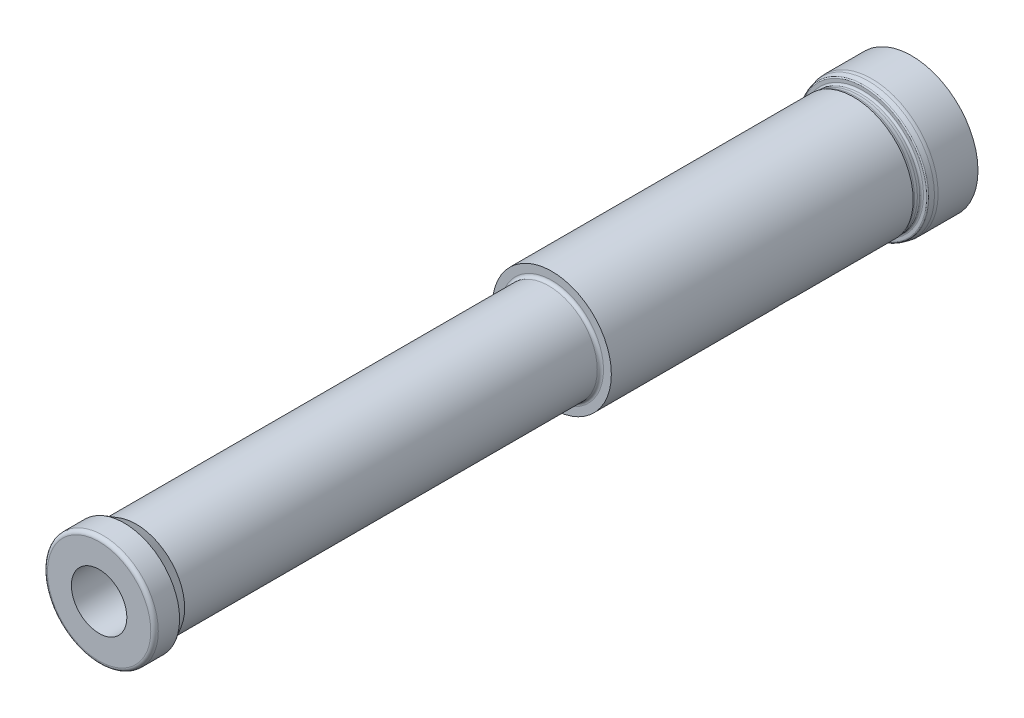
ISO-10303-21;
HEADER;
FILE_DESCRIPTION(('STEP AP214'),'2;1');
FILE_NAME('part.step','',(''),(''),'','','');
FILE_SCHEMA(('AUTOMOTIVE_DESIGN { 1 0 10303 214 1 1 1 1 }'));
ENDSEC;
DATA;
#1=APPLICATION_CONTEXT('core data for automotive mechanical design processes');
#2=APPLICATION_PROTOCOL_DEFINITION('international standard','automotive_design',2000,#1);
#3=PRODUCT_CONTEXT('',#1,'mechanical');
#4=PRODUCT('Part','Part','',(#3));
#5=PRODUCT_RELATED_PRODUCT_CATEGORY('part','',(#4));
#6=PRODUCT_DEFINITION_FORMATION('','',#4);
#7=PRODUCT_DEFINITION_CONTEXT('part definition',#1,'design');
#8=PRODUCT_DEFINITION('design','',#6,#7);
#9=PRODUCT_DEFINITION_SHAPE('','',#8);
#10=(LENGTH_UNIT() NAMED_UNIT(*) SI_UNIT(.MILLI.,.METRE.));
#11=(NAMED_UNIT(*) PLANE_ANGLE_UNIT() SI_UNIT($,.RADIAN.));
#12=(NAMED_UNIT(*) SI_UNIT($,.STERADIAN.) SOLID_ANGLE_UNIT());
#13=UNCERTAINTY_MEASURE_WITH_UNIT(LENGTH_MEASURE(1.E-05),#10,'distance_accuracy_value','');
#14=(GEOMETRIC_REPRESENTATION_CONTEXT(3) GLOBAL_UNCERTAINTY_ASSIGNED_CONTEXT((#13)) GLOBAL_UNIT_ASSIGNED_CONTEXT((#10,
#11,#12)) REPRESENTATION_CONTEXT('',''));
#15=CARTESIAN_POINT('',(0.,0.,0.));
#16=DIRECTION('',(0.,0.,1.));
#17=DIRECTION('',(1.,0.,0.));
#18=AXIS2_PLACEMENT_3D('',#15,#16,#17);
#19=CARTESIAN_POINT('',(0.,0.,20.9919525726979));
#20=DIRECTION('',(0.,0.,1.));
#21=DIRECTION('',(1.,0.,0.));
#22=AXIS2_PLACEMENT_3D('',#19,#20,#21);
#23=CYLINDRICAL_SURFACE('',#22,9.5);
#24=CARTESIAN_POINT('',(0.,0.,-120.5));
#25=DIRECTION('',(0.,0.,1.));
#26=DIRECTION('',(1.,0.,0.));
#27=AXIS2_PLACEMENT_3D('',#24,#25,#26);
#28=CIRCLE('',#27,9.5);
#29=CARTESIAN_POINT('',(9.5,0.,-120.5));
#30=VERTEX_POINT('',#29);
#31=EDGE_CURVE('E363',#30,#30,#28,.T.);
#32=ORIENTED_EDGE('',*,*,#31,.T.);
#33=EDGE_LOOP('',(#32));
#34=FACE_BOUND('',#33,.T.);
#35=CARTESIAN_POINT('',(0.,0.,-72.3));
#36=DIRECTION('',(0.,0.,1.));
#37=DIRECTION('',(1.,0.,0.));
#38=AXIS2_PLACEMENT_3D('',#35,#36,#37);
#39=CIRCLE('',#38,9.5);
#40=CARTESIAN_POINT('',(9.5,0.,-72.3));
#41=VERTEX_POINT('',#40);
#42=EDGE_CURVE('E366',#41,#41,#39,.T.);
#43=ORIENTED_EDGE('',*,*,#42,.F.);
#44=EDGE_LOOP('',(#43));
#45=FACE_BOUND('',#44,.T.);
#46=CARTESIAN_POINT('',(0.414051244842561,-9.4909726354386,-103.824889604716));
#47=CARTESIAN_POINT('',(0.466166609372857,-9.48869381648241,-103.930075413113));
#48=CARTESIAN_POINT('',(0.522848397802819,-9.48579604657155,-104.032901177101));
#49=CARTESIAN_POINT('',(0.644679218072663,-9.47829842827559,-104.233302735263));
#50=CARTESIAN_POINT('',(0.709825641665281,-9.47369910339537,-104.330880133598));
#51=CARTESIAN_POINT('',(0.916930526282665,-9.45665758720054,-104.614922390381));
#52=CARTESIAN_POINT('',(1.07062117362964,-9.44097017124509,-104.792829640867));
#53=CARTESIAN_POINT('',(1.40314310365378,-9.3973017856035,-105.121224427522));
#54=CARTESIAN_POINT('',(1.58196286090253,-9.36932643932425,-105.271724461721));
#55=CARTESIAN_POINT('',(1.95896534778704,-9.29780583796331,-105.541625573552));
#56=CARTESIAN_POINT('',(2.1571428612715,-9.25426476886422,-105.66103499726));
#57=CARTESIAN_POINT('',(2.56557785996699,-9.1494280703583,-105.864441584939));
#58=CARTESIAN_POINT('',(2.77578247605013,-9.08820597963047,-105.948581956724));
#59=CARTESIAN_POINT('',(3.20165993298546,-8.9470423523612,-106.078655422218));
#60=CARTESIAN_POINT('',(3.41732981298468,-8.86711076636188,-106.124608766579));
#61=CARTESIAN_POINT('',(3.83056749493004,-8.69615381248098,-106.174259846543));
#62=CARTESIAN_POINT('',(4.02830822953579,-8.60636290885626,-106.180795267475));
#63=CARTESIAN_POINT('',(4.41555713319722,-8.41424629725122,-106.158900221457));
#64=CARTESIAN_POINT('',(4.60506682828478,-8.31192292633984,-106.130476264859));
#65=CARTESIAN_POINT('',(4.96443289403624,-8.10223928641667,-106.041449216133));
#66=CARTESIAN_POINT('',(5.13473631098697,-7.99516488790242,-105.981962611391));
#67=CARTESIAN_POINT('',(5.45931476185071,-7.77715522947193,-105.83366573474));
#68=CARTESIAN_POINT('',(5.61358662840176,-7.66621921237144,-105.744849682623));
#69=CARTESIAN_POINT('',(5.91087853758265,-7.43963340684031,-105.535562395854));
#70=CARTESIAN_POINT('',(6.05298521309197,-7.32401705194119,-105.413760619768));
#71=CARTESIAN_POINT('',(6.31557188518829,-7.09883964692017,-105.143973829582));
#72=CARTESIAN_POINT('',(6.43604146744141,-6.98928153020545,-104.995976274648));
#73=CARTESIAN_POINT('',(6.6620259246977,-6.7744658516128,-104.665891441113));
#74=CARTESIAN_POINT('',(6.76591621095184,-6.67003842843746,-104.482148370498));
#75=CARTESIAN_POINT('',(6.94705158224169,-6.48117878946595,-104.0923269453));
#76=CARTESIAN_POINT('',(7.02429669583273,-6.3967465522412,-103.886248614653));
#77=CARTESIAN_POINT('',(7.11910914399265,-6.29050782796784,-103.565593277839));
#78=CARTESIAN_POINT('',(7.14712821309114,-6.25859050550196,-103.457274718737));
#79=CARTESIAN_POINT('',(7.19628208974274,-6.20201063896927,-103.237249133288));
#80=CARTESIAN_POINT('',(7.21742004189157,-6.17734478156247,-103.125543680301));
#81=CARTESIAN_POINT('',(7.25270177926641,-6.13588284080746,-102.89965794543));
#82=CARTESIAN_POINT('',(7.26684908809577,-6.11908279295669,-102.785478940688));
#83=CARTESIAN_POINT('',(7.28808750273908,-6.09377194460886,-102.555559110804));
#84=CARTESIAN_POINT('',(7.29517939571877,-6.08526021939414,-102.439818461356));
#85=CARTESIAN_POINT('',(7.30195721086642,-6.07712457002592,-102.217898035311));
#86=CARTESIAN_POINT('',(7.30223302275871,-6.0767927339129,-102.111761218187));
#87=CARTESIAN_POINT('',(7.29686638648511,-6.08323590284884,-101.899856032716));
#88=CARTESIAN_POINT('',(7.29122418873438,-6.09001060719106,-101.794087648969));
#89=CARTESIAN_POINT('',(7.2740521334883,-6.11051092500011,-101.583728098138));
#90=CARTESIAN_POINT('',(7.26252311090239,-6.12423555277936,-101.479136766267));
#91=CARTESIAN_POINT('',(7.23363830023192,-6.15832543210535,-101.271895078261));
#92=CARTESIAN_POINT('',(7.21628426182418,-6.17868868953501,-101.169244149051));
#93=CARTESIAN_POINT('',(7.1757022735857,-6.22577517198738,-100.965934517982));
#94=CARTESIAN_POINT('',(7.15243990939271,-6.25253560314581,-100.865291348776));
#95=CARTESIAN_POINT('',(7.10025071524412,-6.31173159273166,-100.66750578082));
#96=CARTESIAN_POINT('',(7.07133935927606,-6.34415162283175,-100.570354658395));
#97=CARTESIAN_POINT('',(7.03961910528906,-6.37916631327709,-100.47511171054));
#98=B_SPLINE_CURVE_WITH_KNOTS('',3,(#46,#47,#48,#49,#50,#51,#52,#53,#54,#55,#56,#57,#58,#59,#60,
#61,#62,#63,#64,#65,#66,#67,#68,#69,#70,#71,#72,#73,#74,#75,#76,#77,#78,#79,#80,#81,#82,#83,#84,
#85,#86,#87,#88,#89,#90,#91,#92,#93,#94,#95,#96,#97),.UNSPECIFIED.,.F.,.F.,(4,2,2,2,2,2,2,2,2,2,
2,2,2,2,2,2,2,2,2,2,2,2,2,2,2,4),(0.,0.351979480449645,0.703850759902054,1.4071546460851,
2.11013700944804,2.81293046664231,3.51284196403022,4.21238205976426,4.86089683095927,
5.50929084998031,6.13583836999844,6.76250944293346,7.4196879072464,8.07718184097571,
8.78044081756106,9.48369904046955,9.83234624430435,10.1808338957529,10.5291457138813,
10.8774186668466,11.1954342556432,11.5134363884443,11.8313934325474,12.1492550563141,
12.4690123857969,12.7879057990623),.UNSPECIFIED.);
#99=CARTESIAN_POINT('',(0.414051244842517,-9.49097263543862,-103.824889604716));
#100=VERTEX_POINT('',#99);
#101=CARTESIAN_POINT('',(7.03961910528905,-6.3791663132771,-100.475111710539));
#102=VERTEX_POINT('',#101);
#103=EDGE_CURVE('E11',#100,#102,#98,.T.);
#104=ORIENTED_EDGE('',*,*,#103,.F.);
#105=CARTESIAN_POINT('',(0.41405124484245,-9.4909726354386,-103.824889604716));
#106=CARTESIAN_POINT('',(0.239199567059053,-9.49858105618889,-103.442892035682));
#107=CARTESIAN_POINT('',(0.0659728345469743,-9.50131647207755,-103.060069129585));
#108=CARTESIAN_POINT('',(-0.277298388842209,-9.49750826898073,-102.293088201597));
#109=CARTESIAN_POINT('',(-0.447343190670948,-9.49096556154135,-101.908930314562));
#110=CARTESIAN_POINT('',(-0.78434495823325,-9.46906988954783,-101.139537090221));
#111=CARTESIAN_POINT('',(-0.951302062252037,-9.4537173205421,-100.754301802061));
#112=CARTESIAN_POINT('',(-1.28215454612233,-9.41455423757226,-99.9829262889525));
#113=CARTESIAN_POINT('',(-1.44604972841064,-9.39074317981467,-99.5967860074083));
#114=CARTESIAN_POINT('',(-1.8736308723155,-9.31729360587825,-98.5788825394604));
#115=CARTESIAN_POINT('',(-2.13474672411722,-9.26084981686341,-97.9465128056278));
#116=CARTESIAN_POINT('',(-2.52006455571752,-9.16061527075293,-96.9970772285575));
#117=CARTESIAN_POINT('',(-2.64744544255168,-9.12460861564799,-96.6804494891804));
#118=CARTESIAN_POINT('',(-2.90005984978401,-9.04749046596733,-96.0469694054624));
#119=CARTESIAN_POINT('',(-3.02529343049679,-9.00637911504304,-95.7301170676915));
#120=CARTESIAN_POINT('',(-3.14944293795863,-8.96275678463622,-95.4131772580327));
#121=B_SPLINE_CURVE_WITH_KNOTS('',3,(#105,#106,#107,#108,#109,#110,#111,#112,#113,#114,#115,
#116,#117,#118,#119,#120),.UNSPECIFIED.,.F.,.F.,(4,2,2,2,2,2,2,4),(0.,1.26049352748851,
2.5208632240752,3.78117633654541,5.0415704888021,7.10057370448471,8.13009079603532,
9.15957892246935),.UNSPECIFIED.);
#122=CARTESIAN_POINT('',(-3.14944293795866,-8.96275678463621,-95.4131772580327));
#123=VERTEX_POINT('',#122);
#124=EDGE_CURVE('E49',#100,#123,#121,.T.);
#125=ORIENTED_EDGE('',*,*,#124,.T.);
#126=CARTESIAN_POINT('',(-4.025,-8.60519465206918,-90.8087010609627));
#127=CARTESIAN_POINT('',(-4.0273578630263,-8.60406756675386,-91.0118774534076));
#128=CARTESIAN_POINT('',(-4.02459475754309,-8.60538211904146,-91.2151287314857));
#129=CARTESIAN_POINT('',(-4.00877610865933,-8.6127755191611,-91.6210776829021));
#130=CARTESIAN_POINT('',(-3.99572388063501,-8.61885283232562,-91.8237755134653));
#131=CARTESIAN_POINT('',(-3.95927728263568,-8.63565256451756,-92.2280546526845));
#132=CARTESIAN_POINT('',(-3.93588246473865,-8.64637518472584,-92.4296359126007));
#133=CARTESIAN_POINT('',(-3.87875155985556,-8.67215521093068,-92.8310984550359));
#134=CARTESIAN_POINT('',(-3.84501294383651,-8.68721367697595,-93.0309793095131));
#135=CARTESIAN_POINT('',(-3.76949497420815,-8.72023518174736,-93.4169009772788));
#136=CARTESIAN_POINT('',(-3.7282931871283,-8.73797999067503,-93.6030739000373));
#137=CARTESIAN_POINT('',(-3.63681908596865,-8.7764460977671,-93.972904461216));
#138=CARTESIAN_POINT('',(-3.58654501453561,-8.79716797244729,-94.1565616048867));
#139=CARTESIAN_POINT('',(-3.47696675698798,-8.84105193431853,-94.5210827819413));
#140=CARTESIAN_POINT('',(-3.41765283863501,-8.86421664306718,-94.7019435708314));
#141=CARTESIAN_POINT('',(-3.29016486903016,-8.91231793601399,-95.0602269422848));
#142=CARTESIAN_POINT('',(-3.22199291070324,-8.93725410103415,-95.2376503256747));
#143=CARTESIAN_POINT('',(-3.14944293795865,-8.9627567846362,-95.4131772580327));
#144=B_SPLINE_CURVE_WITH_KNOTS('',3,(#126,#127,#128,#129,#130,#131,#132,#133,#134,#135,#136,
#137,#138,#139,#140,#141,#142,#143),.UNSPECIFIED.,.F.,.F.,(4,2,2,2,2,2,2,2,4),(0.,
0.609503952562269,1.21881159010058,1.8281456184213,2.43762874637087,3.01187882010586,
3.58624024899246,4.16122445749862,4.73607305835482),.UNSPECIFIED.);
#145=CARTESIAN_POINT('',(-4.025,-8.60519465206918,-90.8087010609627));
#146=VERTEX_POINT('',#145);
#147=EDGE_CURVE('E398',#146,#123,#144,.T.);
#148=ORIENTED_EDGE('',*,*,#147,.F.);
#149=DIRECTION('',(0.,0.,1.));
#150=VECTOR('',#149,1.);
#151=CARTESIAN_POINT('',(-4.025,-8.60519465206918,20.9919525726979));
#152=LINE('',#151,#150);
#153=CARTESIAN_POINT('',(-4.025,-8.60519465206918,-80.425));
#154=VERTEX_POINT('',#153);
#155=EDGE_CURVE('E393',#146,#154,#152,.T.);
#156=ORIENTED_EDGE('',*,*,#155,.T.);
#157=CARTESIAN_POINT('',(4.02499999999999,-8.60519465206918,-80.425));
#158=CARTESIAN_POINT('',(4.02501669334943,-8.60517054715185,-80.3173321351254));
#159=CARTESIAN_POINT('',(4.02068034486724,-8.60721476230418,-80.2096774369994));
#160=CARTESIAN_POINT('',(4.00343221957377,-8.61525943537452,-79.9952507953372));
#161=CARTESIAN_POINT('',(3.99052411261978,-8.62125820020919,-79.8884784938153));
#162=CARTESIAN_POINT('',(3.95633690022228,-8.63699780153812,-79.6770370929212));
#163=CARTESIAN_POINT('',(3.93509418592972,-8.6467223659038,-79.5723609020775));
#164=CARTESIAN_POINT('',(3.8844850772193,-8.66957574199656,-79.3653943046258));
#165=CARTESIAN_POINT('',(3.85511809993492,-8.682704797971,-79.2631040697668));
#166=CARTESIAN_POINT('',(3.75532206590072,-8.72656183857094,-78.9611013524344));
#167=CARTESIAN_POINT('',(3.67312136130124,-8.76179722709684,-78.7657912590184));
#168=CARTESIAN_POINT('',(3.48001748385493,-8.8402652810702,-78.3916344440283));
#169=CARTESIAN_POINT('',(3.36908324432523,-8.88350658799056,-78.2128058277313));
#170=CARTESIAN_POINT('',(3.11411988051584,-8.97617234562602,-77.8653266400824));
#171=CARTESIAN_POINT('',(2.96854829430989,-9.02580973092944,-77.6978620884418));
#172=CARTESIAN_POINT('',(2.65170491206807,-9.12392177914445,-77.3888702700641));
#173=CARTESIAN_POINT('',(2.48042752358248,-9.17239618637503,-77.2473486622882));
#174=CARTESIAN_POINT('',(2.10751032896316,-9.26536108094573,-76.9880142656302));
#175=CARTESIAN_POINT('',(1.90484793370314,-9.30957238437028,-76.8715625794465));
#176=CARTESIAN_POINT('',(1.48059784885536,-9.38638324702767,-76.6749275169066));
#177=CARTESIAN_POINT('',(1.25901896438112,-9.41898817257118,-76.594727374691));
#178=CARTESIAN_POINT('',(0.815820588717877,-9.46738764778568,-76.4772458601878));
#179=CARTESIAN_POINT('',(0.594839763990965,-9.48398950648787,-76.4378945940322));
#180=CARTESIAN_POINT('',(0.148826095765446,-9.50145126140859,-76.3965292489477));
#181=CARTESIAN_POINT('',(-0.0762050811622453,-9.50231749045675,-76.3945001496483));
#182=CARTESIAN_POINT('',(-0.508840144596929,-9.48867797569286,-76.4267755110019));
#183=CARTESIAN_POINT('',(-0.716650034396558,-9.47513550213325,-76.4588030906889));
#184=CARTESIAN_POINT('',(-1.12361759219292,-9.43553384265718,-76.5543662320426));
#185=CARTESIAN_POINT('',(-1.32277477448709,-9.40947395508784,-76.6179035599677));
#186=CARTESIAN_POINT('',(-1.7104583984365,-9.346845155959,-76.7754210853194));
#187=CARTESIAN_POINT('',(-1.89877563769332,-9.31012159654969,-76.8698520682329));
#188=CARTESIAN_POINT('',(-2.25739159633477,-9.22973476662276,-77.0860363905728));
#189=CARTESIAN_POINT('',(-2.42768363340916,-9.18606893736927,-77.2077998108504));
#190=CARTESIAN_POINT('',(-2.75851243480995,-9.09242981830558,-77.4854070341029));
#191=CARTESIAN_POINT('',(-2.91744809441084,-9.04222875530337,-77.6430810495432));
#192=CARTESIAN_POINT('',(-3.20740198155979,-8.94349368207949,-77.9830591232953));
#193=CARTESIAN_POINT('',(-3.33840537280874,-8.89496056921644,-78.1653761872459));
#194=CARTESIAN_POINT('',(-3.51328438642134,-8.8267177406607,-78.4575142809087));
#195=CARTESIAN_POINT('',(-3.56873458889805,-8.80438402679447,-78.5599593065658));
#196=CARTESIAN_POINT('',(-3.67071814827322,-8.7623551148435,-78.7696963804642));
#197=CARTESIAN_POINT('',(-3.7172553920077,-8.74265876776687,-78.8769862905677));
#198=CARTESIAN_POINT('',(-3.80090498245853,-8.70661813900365,-79.0955556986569));
#199=CARTESIAN_POINT('',(-3.83802989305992,-8.69026939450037,-79.2068296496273));
#200=CARTESIAN_POINT('',(-3.90251076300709,-8.66150372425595,-79.4326205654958));
#201=CARTESIAN_POINT('',(-3.92987107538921,-8.64908504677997,-79.5471360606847));
#202=CARTESIAN_POINT('',(-3.97631879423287,-8.62784097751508,-79.7880202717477));
#203=CARTESIAN_POINT('',(-3.99454310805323,-8.61939406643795,-79.9145905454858));
#204=CARTESIAN_POINT('',(-4.01890007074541,-8.60804708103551,-80.1691011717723));
#205=CARTESIAN_POINT('',(-4.02503555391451,-8.6051457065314,-80.2970411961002));
#206=CARTESIAN_POINT('',(-4.025,-8.60519465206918,-80.425));
#207=B_SPLINE_CURVE_WITH_KNOTS('',3,(#157,#158,#159,#160,#161,#162,#163,#164,#165,#166,#167,
#168,#169,#170,#171,#172,#173,#174,#175,#176,#177,#178,#179,#180,#181,#182,#183,#184,#185,#186,
#187,#188,#189,#190,#191,#192,#193,#194,#195,#196,#197,#198,#199,#200,#201,#202,#203,#204,#205,
#206),.UNSPECIFIED.,.F.,.F.,(4,2,2,2,2,2,2,2,2,2,2,2,2,2,2,2,2,2,2,2,2,2,2,2,4),(0.,
0.322875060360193,0.645611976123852,0.96695514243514,1.28832136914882,1.92965165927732,
2.57167827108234,3.25082007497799,3.93010984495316,4.64010964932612,5.34978075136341,
6.0214163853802,6.69278171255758,7.32192694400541,7.95110744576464,8.58991182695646,
9.22895220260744,9.91429981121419,10.6000105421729,10.9554581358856,11.3107503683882,
11.6655658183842,12.0202228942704,12.4039825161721,12.7876521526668),.UNSPECIFIED.);
#208=CARTESIAN_POINT('',(4.02499999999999,-8.60519465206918,-80.425));
#209=VERTEX_POINT('',#208);
#210=EDGE_CURVE('E111',#209,#154,#207,.T.);
#211=ORIENTED_EDGE('',*,*,#210,.F.);
#212=DIRECTION('',(0.,0.,1.));
#213=VECTOR('',#212,1.);
#214=CARTESIAN_POINT('',(4.02499999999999,-8.60519465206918,20.9919525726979));
#215=LINE('',#214,#213);
#216=CARTESIAN_POINT('',(4.02499999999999,-8.60519465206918,-90.8087010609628));
#217=VERTEX_POINT('',#216);
#218=EDGE_CURVE('E394',#209,#217,#215,.F.);
#219=ORIENTED_EDGE('',*,*,#218,.T.);
#220=CARTESIAN_POINT('',(4.27025049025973,-8.48616289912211,-92.3271591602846));
#221=CARTESIAN_POINT('',(4.24568826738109,-8.49852245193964,-92.2606655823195));
#222=CARTESIAN_POINT('',(4.22259993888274,-8.51000693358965,-92.1934404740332));
#223=CARTESIAN_POINT('',(4.17978666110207,-8.53111683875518,-92.0576449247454));
#224=CARTESIAN_POINT('',(4.16006168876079,-8.54074227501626,-91.9890744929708));
#225=CARTESIAN_POINT('',(4.12437999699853,-8.55803036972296,-91.8506648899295));
#226=CARTESIAN_POINT('',(4.10842547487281,-8.56569188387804,-91.7808250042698));
#227=CARTESIAN_POINT('',(4.08055672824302,-8.57900322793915,-91.6401472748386));
#228=CARTESIAN_POINT('',(4.06864271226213,-8.5846529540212,-91.5693093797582));
#229=CARTESIAN_POINT('',(4.05091192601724,-8.59303133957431,-91.4412081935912));
#230=CARTESIAN_POINT('',(4.04435172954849,-8.59611849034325,-91.3840694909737));
#231=CARTESIAN_POINT('',(4.03381844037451,-8.60106635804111,-91.2694879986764));
#232=CARTESIAN_POINT('',(4.02984594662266,-8.60292679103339,-91.2120451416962));
#233=CARTESIAN_POINT('',(4.02438128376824,-8.6054846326,-91.0969397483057));
#234=CARTESIAN_POINT('',(4.02289256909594,-8.60618042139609,-91.039277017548));
#235=CARTESIAN_POINT('',(4.02224284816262,-8.6064834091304,-90.9239589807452));
#236=CARTESIAN_POINT('',(4.02308084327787,-8.60609107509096,-90.8663036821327));
#237=CARTESIAN_POINT('',(4.02499999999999,-8.60519465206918,-90.8087010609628));
#238=B_SPLINE_CURVE_WITH_KNOTS('',3,(#220,#221,#222,#223,#224,#225,#226,#227,#228,#229,#230,
#231,#232,#233,#234,#235,#236,#237),.UNSPECIFIED.,.F.,.F.,(4,2,2,2,2,2,2,2,4),(0.,
0.215873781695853,0.43174608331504,0.64774387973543,0.863752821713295,1.03647243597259,
1.20923201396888,1.38223166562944,1.55515707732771),.UNSPECIFIED.);
#239=CARTESIAN_POINT('',(4.27025049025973,-8.48616289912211,-92.3271591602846));
#240=VERTEX_POINT('',#239);
#241=EDGE_CURVE('E65',#240,#217,#238,.T.);
#242=ORIENTED_EDGE('',*,*,#241,.F.);
#243=CARTESIAN_POINT('',(4.27025049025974,-8.4861628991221,-92.3271591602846));
#244=CARTESIAN_POINT('',(4.41405574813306,-8.41378933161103,-92.7151754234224));
#245=CARTESIAN_POINT('',(4.5562473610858,-8.33766708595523,-93.1030940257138));
#246=CARTESIAN_POINT('',(4.83728263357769,-8.17782849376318,-93.8785988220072));
#247=CARTESIAN_POINT('',(4.97612614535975,-8.09411181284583,-94.2661850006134));
#248=CARTESIAN_POINT('',(5.25033288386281,-7.91899331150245,-95.0408565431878));
#249=CARTESIAN_POINT('',(5.38569608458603,-7.82759143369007,-95.4279419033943));
#250=CARTESIAN_POINT('',(5.65275788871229,-7.63696591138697,-96.2014454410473));
#251=CARTESIAN_POINT('',(5.78445656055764,-7.53774241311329,-96.5878636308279));
#252=CARTESIAN_POINT('',(6.0127144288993,-7.35616086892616,-97.2668416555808));
#253=CARTESIAN_POINT('',(6.11009395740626,-7.27550025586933,-97.5595807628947));
#254=CARTESIAN_POINT('',(6.30252727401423,-7.10945140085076,-98.1444849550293));
#255=CARTESIAN_POINT('',(6.39758105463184,-7.02406314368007,-98.4366500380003));
#256=CARTESIAN_POINT('',(6.58528078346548,-6.84840233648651,-99.0203555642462));
#257=CARTESIAN_POINT('',(6.67792624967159,-6.75812881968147,-99.3118958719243));
#258=CARTESIAN_POINT('',(6.86069191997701,-6.57250575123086,-99.8941560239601));
#259=CARTESIAN_POINT('',(6.95081208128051,-6.47715611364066,-100.184875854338));
#260=CARTESIAN_POINT('',(7.03961910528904,-6.37916631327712,-100.475111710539));
#261=B_SPLINE_CURVE_WITH_KNOTS('',3,(#243,#244,#245,#246,#247,#248,#249,#250,#251,#252,#253,
#254,#255,#256,#257,#258,#259,#260),.UNSPECIFIED.,.F.,.F.,(4,2,2,2,2,2,2,2,4),(0.,
1.2602510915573,2.52055769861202,3.78087371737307,5.04116618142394,5.99776859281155,
6.95437408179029,7.91116957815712,8.86798127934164),.UNSPECIFIED.);
#262=EDGE_CURVE('E265',#240,#102,#261,.T.);
#263=ORIENTED_EDGE('',*,*,#262,.T.);
#264=EDGE_LOOP('',(#104,#125,#148,#156,#211,#219,#242,#263));
#265=FACE_BOUND('',#264,.T.);
#266=ADVANCED_FACE('F39',(#34,#45,#265),#23,.T.);
#267=CARTESIAN_POINT('',(0.,10.6,-129.75));
#268=DIRECTION('',(0.,0.,1.));
#269=DIRECTION('',(1.,0.,0.));
#270=AXIS2_PLACEMENT_3D('',#267,#268,#269);
#271=PLANE('',#270);
#272=CARTESIAN_POINT('',(0.,0.,-129.75));
#273=DIRECTION('',(0.,0.,1.));
#274=DIRECTION('',(1.,0.,0.));
#275=AXIS2_PLACEMENT_3D('',#272,#273,#274);
#276=CIRCLE('',#275,10.6);
#277=CARTESIAN_POINT('',(10.6,0.,-129.75));
#278=VERTEX_POINT('',#277);
#279=EDGE_CURVE('E126',#278,#278,#276,.T.);
#280=ORIENTED_EDGE('',*,*,#279,.F.);
#281=EDGE_LOOP('',(#280));
#282=FACE_BOUND('',#281,.T.);
#283=CARTESIAN_POINT('',(0.,0.,-129.75));
#284=DIRECTION('',(0.,0.,1.));
#285=DIRECTION('',(1.,0.,0.));
#286=AXIS2_PLACEMENT_3D('',#283,#284,#285);
#287=CIRCLE('',#286,4.4275);
#288=CARTESIAN_POINT('',(4.4275,0.,-129.75));
#289=VERTEX_POINT('',#288);
#290=EDGE_CURVE('E389',#289,#289,#287,.T.);
#291=ORIENTED_EDGE('',*,*,#290,.T.);
#292=EDGE_LOOP('',(#291));
#293=FACE_BOUND('',#292,.T.);
#294=ADVANCED_FACE('F41',(#282,#293),#271,.F.);
#295=CARTESIAN_POINT('',(0.,0.,20.9919525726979));
#296=DIRECTION('',(0.,0.,1.));
#297=DIRECTION('',(1.,0.,0.));
#298=AXIS2_PLACEMENT_3D('',#295,#296,#297);
#299=CYLINDRICAL_SURFACE('',#298,4.4275);
#300=ORIENTED_EDGE('',*,*,#290,.F.);
#301=EDGE_LOOP('',(#300));
#302=FACE_BOUND('',#301,.T.);
#303=CARTESIAN_POINT('',(0.,0.,0.));
#304=DIRECTION('',(0.,0.,1.));
#305=DIRECTION('',(1.,0.,0.));
#306=AXIS2_PLACEMENT_3D('',#303,#304,#305);
#307=CIRCLE('',#306,4.4275);
#308=CARTESIAN_POINT('',(4.4275,0.,0.));
#309=VERTEX_POINT('',#308);
#310=EDGE_CURVE('E387',#309,#309,#307,.T.);
#311=ORIENTED_EDGE('',*,*,#310,.T.);
#312=EDGE_LOOP('',(#311));
#313=FACE_BOUND('',#312,.T.);
#314=ADVANCED_FACE('F537',(#302,#313),#299,.F.);
#315=CARTESIAN_POINT('',(0.,4.4275,0.));
#316=DIRECTION('',(0.,0.,-1.));
#317=DIRECTION('',(-1.,0.,0.));
#318=AXIS2_PLACEMENT_3D('',#315,#316,#317);
#319=PLANE('',#318);
#320=ORIENTED_EDGE('',*,*,#310,.F.);
#321=EDGE_LOOP('',(#320));
#322=FACE_BOUND('',#321,.T.);
#323=CARTESIAN_POINT('',(0.,0.,0.));
#324=DIRECTION('',(0.,0.,1.));
#325=DIRECTION('',(1.,0.,0.));
#326=AXIS2_PLACEMENT_3D('',#323,#324,#325);
#327=CIRCLE('',#326,8.25);
#328=CARTESIAN_POINT('',(8.25,0.,0.));
#329=VERTEX_POINT('',#328);
#330=EDGE_CURVE('E384',#329,#329,#327,.T.);
#331=ORIENTED_EDGE('',*,*,#330,.T.);
#332=EDGE_LOOP('',(#331));
#333=FACE_BOUND('',#332,.T.);
#334=ADVANCED_FACE('F541',(#322,#333),#319,.F.);
#335=CARTESIAN_POINT('',(0.,0.,-0.6));
#336=DIRECTION('',(0.,0.,1.));
#337=DIRECTION('',(1.,0.,0.));
#338=AXIS2_PLACEMENT_3D('',#335,#336,#337);
#339=TOROIDAL_SURFACE('',#338,8.25,0.6);
#340=ORIENTED_EDGE('',*,*,#330,.F.);
#341=EDGE_LOOP('',(#340));
#342=FACE_BOUND('',#341,.T.);
#343=CARTESIAN_POINT('',(0.,0.,-0.600000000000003));
#344=DIRECTION('',(0.,0.,1.));
#345=DIRECTION('',(1.,0.,0.));
#346=AXIS2_PLACEMENT_3D('',#343,#344,#345);
#347=CIRCLE('',#346,8.85);
#348=CARTESIAN_POINT('',(8.85,0.,-0.600000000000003));
#349=VERTEX_POINT('',#348);
#350=EDGE_CURVE('E381',#349,#349,#347,.T.);
#351=ORIENTED_EDGE('',*,*,#350,.T.);
#352=EDGE_LOOP('',(#351));
#353=FACE_BOUND('',#352,.T.);
#354=ADVANCED_FACE('F546',(#342,#353),#339,.T.);
#355=CARTESIAN_POINT('',(0.,0.,20.9919525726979));
#356=DIRECTION('',(0.,0.,1.));
#357=DIRECTION('',(1.,0.,0.));
#358=AXIS2_PLACEMENT_3D('',#355,#356,#357);
#359=CYLINDRICAL_SURFACE('',#358,8.85);
#360=ORIENTED_EDGE('',*,*,#350,.F.);
#361=EDGE_LOOP('',(#360));
#362=FACE_BOUND('',#361,.T.);
#363=CARTESIAN_POINT('',(0.,0.,-4.));
#364=DIRECTION('',(0.,0.,1.));
#365=DIRECTION('',(1.,0.,0.));
#366=AXIS2_PLACEMENT_3D('',#363,#364,#365);
#367=CIRCLE('',#366,8.85);
#368=CARTESIAN_POINT('',(8.85,0.,-4.));
#369=VERTEX_POINT('',#368);
#370=EDGE_CURVE('E378',#369,#369,#367,.T.);
#371=ORIENTED_EDGE('',*,*,#370,.T.);
#372=EDGE_LOOP('',(#371));
#373=FACE_BOUND('',#372,.T.);
#374=ADVANCED_FACE('F553',(#362,#373),#359,.T.);
#375=CARTESIAN_POINT('',(0.,0.,-5.90525588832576));
#376=DIRECTION('',(0.,0.,1.));
#377=DIRECTION('',(1.,0.,0.));
#378=AXIS2_PLACEMENT_3D('',#375,#376,#377);
#379=CONICAL_SURFACE('',#378,7.75,0.523598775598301);
#380=ORIENTED_EDGE('',*,*,#370,.F.);
#381=EDGE_LOOP('',(#380));
#382=FACE_BOUND('',#381,.T.);
#383=CARTESIAN_POINT('',(0.,0.,-5.90525588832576));
#384=DIRECTION('',(0.,0.,1.));
#385=DIRECTION('',(1.,0.,0.));
#386=AXIS2_PLACEMENT_3D('',#383,#384,#385);
#387=CIRCLE('',#386,7.75);
#388=CARTESIAN_POINT('',(7.75,0.,-5.90525588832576));
#389=VERTEX_POINT('',#388);
#390=EDGE_CURVE('E375',#389,#389,#387,.T.);
#391=ORIENTED_EDGE('',*,*,#390,.T.);
#392=EDGE_LOOP('',(#391));
#393=FACE_BOUND('',#392,.T.);
#394=ADVANCED_FACE('F557',(#382,#393),#379,.T.);
#395=CARTESIAN_POINT('',(0.,0.,20.9919525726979));
#396=DIRECTION('',(0.,0.,1.));
#397=DIRECTION('',(1.,0.,0.));
#398=AXIS2_PLACEMENT_3D('',#395,#396,#397);
#399=CYLINDRICAL_SURFACE('',#398,7.75);
#400=ORIENTED_EDGE('',*,*,#390,.F.);
#401=EDGE_LOOP('',(#400));
#402=FACE_BOUND('',#401,.T.);
#403=CARTESIAN_POINT('',(0.,0.,-71.8));
#404=DIRECTION('',(0.,0.,1.));
#405=DIRECTION('',(1.,0.,0.));
#406=AXIS2_PLACEMENT_3D('',#403,#404,#405);
#407=CIRCLE('',#406,7.75);
#408=CARTESIAN_POINT('',(7.75,0.,-71.8));
#409=VERTEX_POINT('',#408);
#410=EDGE_CURVE('E372',#409,#409,#407,.T.);
#411=ORIENTED_EDGE('',*,*,#410,.T.);
#412=EDGE_LOOP('',(#411));
#413=FACE_BOUND('',#412,.T.);
#414=ADVANCED_FACE('F561',(#402,#413),#399,.T.);
#415=CARTESIAN_POINT('',(0.,0.,-71.8));
#416=DIRECTION('',(0.,0.,1.));
#417=DIRECTION('',(1.,0.,0.));
#418=AXIS2_PLACEMENT_3D('',#415,#416,#417);
#419=TOROIDAL_SURFACE('',#418,8.25,0.5);
#420=ORIENTED_EDGE('',*,*,#410,.F.);
#421=EDGE_LOOP('',(#420));
#422=FACE_BOUND('',#421,.T.);
#423=CARTESIAN_POINT('',(0.,0.,-72.3));
#424=DIRECTION('',(0.,0.,1.));
#425=DIRECTION('',(1.,0.,0.));
#426=AXIS2_PLACEMENT_3D('',#423,#424,#425);
#427=CIRCLE('',#426,8.25);
#428=CARTESIAN_POINT('',(8.25,0.,-72.3));
#429=VERTEX_POINT('',#428);
#430=EDGE_CURVE('E369',#429,#429,#427,.T.);
#431=ORIENTED_EDGE('',*,*,#430,.T.);
#432=EDGE_LOOP('',(#431));
#433=FACE_BOUND('',#432,.T.);
#434=ADVANCED_FACE('F564',(#422,#433),#419,.F.);
#435=CARTESIAN_POINT('',(0.,8.25,-72.3));
#436=DIRECTION('',(0.,0.,-1.));
#437=DIRECTION('',(-1.,0.,0.));
#438=AXIS2_PLACEMENT_3D('',#435,#436,#437);
#439=PLANE('',#438);
#440=ORIENTED_EDGE('',*,*,#430,.F.);
#441=EDGE_LOOP('',(#440));
#442=FACE_BOUND('',#441,.T.);
#443=ORIENTED_EDGE('',*,*,#42,.T.);
#444=EDGE_LOOP('',(#443));
#445=FACE_BOUND('',#444,.T.);
#446=ADVANCED_FACE('F274',(#442,#445),#439,.F.);
#447=CARTESIAN_POINT('',(0.,0.,-120.805474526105));
#448=DIRECTION('',(0.,0.,1.));
#449=DIRECTION('',(1.,0.,0.));
#450=AXIS2_PLACEMENT_3D('',#447,#448,#449);
#451=CONICAL_SURFACE('',#450,9.41814834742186,0.261799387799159);
#452=ORIENTED_EDGE('',*,*,#31,.F.);
#453=EDGE_LOOP('',(#452));
#454=FACE_BOUND('',#453,.T.);
#455=CARTESIAN_POINT('',(0.,0.,-120.805474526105));
#456=DIRECTION('',(0.,0.,1.));
#457=DIRECTION('',(1.,0.,0.));
#458=AXIS2_PLACEMENT_3D('',#455,#456,#457);
#459=CIRCLE('',#458,9.41814834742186);
#460=CARTESIAN_POINT('',(9.41814834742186,0.,-120.805474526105));
#461=VERTEX_POINT('',#460);
#462=EDGE_CURVE('E360',#461,#461,#459,.T.);
#463=ORIENTED_EDGE('',*,*,#462,.T.);
#464=EDGE_LOOP('',(#463));
#465=FACE_BOUND('',#464,.T.);
#466=ADVANCED_FACE('F272',(#454,#465),#451,.T.);
#467=CARTESIAN_POINT('',(0.,0.,-121.32311261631));
#468=DIRECTION('',(0.,0.,1.));
#469=DIRECTION('',(1.,0.,0.));
#470=AXIS2_PLACEMENT_3D('',#467,#468,#469);
#471=TOROIDAL_SURFACE('',#470,11.35,2.);
#472=ORIENTED_EDGE('',*,*,#462,.F.);
#473=EDGE_LOOP('',(#472));
#474=FACE_BOUND('',#473,.T.);
#475=CARTESIAN_POINT('',(0.,0.,-121.32311261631));
#476=DIRECTION('',(0.,0.,1.));
#477=DIRECTION('',(1.,0.,0.));
#478=AXIS2_PLACEMENT_3D('',#475,#476,#477);
#479=CIRCLE('',#478,9.35);
#480=CARTESIAN_POINT('',(9.35,0.,-121.32311261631));
#481=VERTEX_POINT('',#480);
#482=EDGE_CURVE('E357',#481,#481,#479,.T.);
#483=ORIENTED_EDGE('',*,*,#482,.T.);
#484=EDGE_LOOP('',(#483));
#485=FACE_BOUND('',#484,.T.);
#486=ADVANCED_FACE('F510',(#474,#485),#471,.F.);
#487=CARTESIAN_POINT('',(0.,0.,20.9919525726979));
#488=DIRECTION('',(0.,0.,1.));
#489=DIRECTION('',(1.,0.,0.));
#490=AXIS2_PLACEMENT_3D('',#487,#488,#489);
#491=CYLINDRICAL_SURFACE('',#490,9.35);
#492=ORIENTED_EDGE('',*,*,#482,.F.);
#493=EDGE_LOOP('',(#492));
#494=FACE_BOUND('',#493,.T.);
#495=CARTESIAN_POINT('',(0.,0.,-121.7));
#496=DIRECTION('',(0.,0.,1.));
#497=DIRECTION('',(1.,0.,0.));
#498=AXIS2_PLACEMENT_3D('',#495,#496,#497);
#499=CIRCLE('',#498,9.35);
#500=CARTESIAN_POINT('',(9.35,0.,-121.7));
#501=VERTEX_POINT('',#500);
#502=EDGE_CURVE('E354',#501,#501,#499,.T.);
#503=ORIENTED_EDGE('',*,*,#502,.T.);
#504=EDGE_LOOP('',(#503));
#505=FACE_BOUND('',#504,.T.);
#506=ADVANCED_FACE('F507',(#494,#505),#491,.T.);
#507=CARTESIAN_POINT('',(0.,0.,-121.7));
#508=DIRECTION('',(0.,0.,1.));
#509=DIRECTION('',(1.,0.,0.));
#510=AXIS2_PLACEMENT_3D('',#507,#508,#509);
#511=TOROIDAL_SURFACE('',#510,9.65,0.299999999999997);
#512=ORIENTED_EDGE('',*,*,#502,.F.);
#513=EDGE_LOOP('',(#512));
#514=FACE_BOUND('',#513,.T.);
#515=CARTESIAN_POINT('',(0.,0.,-122.));
#516=DIRECTION('',(0.,0.,1.));
#517=DIRECTION('',(1.,0.,0.));
#518=AXIS2_PLACEMENT_3D('',#515,#516,#517);
#519=CIRCLE('',#518,9.65);
#520=CARTESIAN_POINT('',(9.65,0.,-122.));
#521=VERTEX_POINT('',#520);
#522=EDGE_CURVE('E351',#521,#521,#519,.T.);
#523=ORIENTED_EDGE('',*,*,#522,.T.);
#524=EDGE_LOOP('',(#523));
#525=FACE_BOUND('',#524,.T.);
#526=ADVANCED_FACE('F503',(#514,#525),#511,.F.);
#527=CARTESIAN_POINT('',(0.,9.65,-122.));
#528=DIRECTION('',(0.,0.,-1.));
#529=DIRECTION('',(-1.,0.,0.));
#530=AXIS2_PLACEMENT_3D('',#527,#528,#529);
#531=PLANE('',#530);
#532=ORIENTED_EDGE('',*,*,#522,.F.);
#533=EDGE_LOOP('',(#532));
#534=FACE_BOUND('',#533,.T.);
#535=CARTESIAN_POINT('',(0.,0.,-122.));
#536=DIRECTION('',(0.,0.,1.));
#537=DIRECTION('',(1.,0.,0.));
#538=AXIS2_PLACEMENT_3D('',#535,#536,#537);
#539=CIRCLE('',#538,10.1465346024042);
#540=CARTESIAN_POINT('',(10.1465346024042,0.,-122.));
#541=VERTEX_POINT('',#540);
#542=EDGE_CURVE('E348',#541,#541,#539,.T.);
#543=ORIENTED_EDGE('',*,*,#542,.T.);
#544=EDGE_LOOP('',(#543));
#545=FACE_BOUND('',#544,.T.);
#546=ADVANCED_FACE('F499',(#534,#545),#531,.F.);
#547=CARTESIAN_POINT('',(0.,0.,-122.2));
#548=DIRECTION('',(0.,0.,1.));
#549=DIRECTION('',(1.,0.,0.));
#550=AXIS2_PLACEMENT_3D('',#547,#548,#549);
#551=TOROIDAL_SURFACE('',#550,10.1465346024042,0.200000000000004);
#552=ORIENTED_EDGE('',*,*,#542,.F.);
#553=EDGE_LOOP('',(#552));
#554=FACE_BOUND('',#553,.T.);
#555=CARTESIAN_POINT('',(0.,0.,-122.148236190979));
#556=DIRECTION('',(0.,0.,1.));
#557=DIRECTION('',(1.,0.,0.));
#558=AXIS2_PLACEMENT_3D('',#555,#556,#557);
#559=CIRCLE('',#558,10.339719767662);
#560=CARTESIAN_POINT('',(10.339719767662,0.,-122.148236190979));
#561=VERTEX_POINT('',#560);
#562=EDGE_CURVE('E345',#561,#561,#559,.T.);
#563=ORIENTED_EDGE('',*,*,#562,.T.);
#564=EDGE_LOOP('',(#563));
#565=FACE_BOUND('',#564,.T.);
#566=ADVANCED_FACE('F495',(#554,#565),#551,.T.);
#567=CARTESIAN_POINT('',(0.,0.,-122.86528214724));
#568=DIRECTION('',(0.,0.,-1.));
#569=DIRECTION('',(-1.,0.,0.));
#570=AXIS2_PLACEMENT_3D('',#567,#568,#569);
#571=CONICAL_SURFACE('',#570,10.5318516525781,0.261799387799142);
#572=ORIENTED_EDGE('',*,*,#562,.F.);
#573=EDGE_LOOP('',(#572));
#574=FACE_BOUND('',#573,.T.);
#575=CARTESIAN_POINT('',(0.,0.,-122.86528214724));
#576=DIRECTION('',(0.,0.,1.));
#577=DIRECTION('',(1.,0.,0.));
#578=AXIS2_PLACEMENT_3D('',#575,#576,#577);
#579=CIRCLE('',#578,10.5318516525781);
#580=CARTESIAN_POINT('',(10.5318516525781,0.,-122.86528214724));
#581=VERTEX_POINT('',#580);
#582=EDGE_CURVE('E342',#581,#581,#579,.T.);
#583=ORIENTED_EDGE('',*,*,#582,.T.);
#584=EDGE_LOOP('',(#583));
#585=FACE_BOUND('',#584,.T.);
#586=ADVANCED_FACE('F491',(#574,#585),#571,.T.);
#587=CARTESIAN_POINT('',(0.,0.,-123.382920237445));
#588=DIRECTION('',(0.,0.,1.));
#589=DIRECTION('',(1.,0.,0.));
#590=AXIS2_PLACEMENT_3D('',#587,#588,#589);
#591=TOROIDAL_SURFACE('',#590,8.6,2.);
#592=ORIENTED_EDGE('',*,*,#582,.F.);
#593=EDGE_LOOP('',(#592));
#594=FACE_BOUND('',#593,.T.);
#595=CARTESIAN_POINT('',(0.,0.,-123.382920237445));
#596=DIRECTION('',(0.,0.,1.));
#597=DIRECTION('',(1.,0.,0.));
#598=AXIS2_PLACEMENT_3D('',#595,#596,#597);
#599=CIRCLE('',#598,10.6);
#600=CARTESIAN_POINT('',(10.6,0.,-123.382920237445));
#601=VERTEX_POINT('',#600);
#602=EDGE_CURVE('E339',#601,#601,#599,.T.);
#603=ORIENTED_EDGE('',*,*,#602,.T.);
#604=EDGE_LOOP('',(#603));
#605=FACE_BOUND('',#604,.T.);
#606=ADVANCED_FACE('F487',(#594,#605),#591,.T.);
#607=CARTESIAN_POINT('',(0.,0.,20.9919525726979));
#608=DIRECTION('',(0.,0.,1.));
#609=DIRECTION('',(1.,0.,0.));
#610=AXIS2_PLACEMENT_3D('',#607,#608,#609);
#611=CYLINDRICAL_SURFACE('',#610,10.6);
#612=ORIENTED_EDGE('',*,*,#602,.F.);
#613=EDGE_LOOP('',(#612));
#614=FACE_BOUND('',#613,.T.);
#615=ORIENTED_EDGE('',*,*,#279,.T.);
#616=EDGE_LOOP('',(#615));
#617=FACE_BOUND('',#616,.T.);
#618=ADVANCED_FACE('F475',(#614,#617),#611,.T.);
#619=CARTESIAN_POINT('',(4.025,-11.45,-90.8087010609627));
#620=DIRECTION('',(1.,0.,0.));
#621=DIRECTION('',(0.,1.,0.));
#622=AXIS2_PLACEMENT_3D('',#619,#620,#621);
#623=PLANE('',#622);
#624=DIRECTION('',(0.,1.,0.));
#625=VECTOR('',#624,1.);
#626=CARTESIAN_POINT('',(4.025,-11.45,-80.425));
#627=LINE('',#626,#625);
#628=CARTESIAN_POINT('',(4.02499999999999,-6.45,-80.425));
#629=VERTEX_POINT('',#628);
#630=EDGE_CURVE('E57',#209,#629,#627,.T.);
#631=ORIENTED_EDGE('',*,*,#630,.T.);
#632=DIRECTION('',(0.,0.,1.));
#633=VECTOR('',#632,1.);
#634=CARTESIAN_POINT('',(4.02499999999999,-6.45,-90.8087010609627));
#635=LINE('',#634,#633);
#636=CARTESIAN_POINT('',(4.02499999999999,-6.45,-90.8087010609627));
#637=VERTEX_POINT('',#636);
#638=EDGE_CURVE('E127',#637,#629,#635,.T.);
#639=ORIENTED_EDGE('',*,*,#638,.F.);
#640=CARTESIAN_POINT('',(4.025,-11.45,-90.8087010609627));
#641=CARTESIAN_POINT('',(4.025,-9.78333333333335,-90.8087010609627));
#642=CARTESIAN_POINT('',(4.02499999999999,-8.11666666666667,-90.8087010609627));
#643=CARTESIAN_POINT('',(4.02499999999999,-6.45,-90.8087010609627));
#644=B_SPLINE_CURVE_WITH_KNOTS('',3,(#640,#641,#642,#643),.UNSPECIFIED.,.F.,.F.,(4,4),(0.,1.),.UNSPECIFIED.);
#645=EDGE_CURVE('E114',#217,#637,#644,.T.);
#646=ORIENTED_EDGE('',*,*,#645,.F.);
#647=ORIENTED_EDGE('',*,*,#218,.F.);
#648=EDGE_LOOP('',(#631,#639,#646,#647));
#649=FACE_BOUND('',#648,.T.);
#650=ADVANCED_FACE('F471',(#649),#623,.F.);
#651=CARTESIAN_POINT('',(-4.025,-11.45,-90.8087010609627));
#652=DIRECTION('',(-1.,0.,0.));
#653=DIRECTION('',(0.,0.,1.));
#654=AXIS2_PLACEMENT_3D('',#651,#652,#653);
#655=PLANE('',#654);
#656=CARTESIAN_POINT('',(-4.025,-6.45,-90.8087010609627));
#657=CARTESIAN_POINT('',(-4.025,-8.11666666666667,-90.8087010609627));
#658=CARTESIAN_POINT('',(-4.025,-9.78333333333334,-90.8087010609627));
#659=CARTESIAN_POINT('',(-4.025,-11.45,-90.8087010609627));
#660=B_SPLINE_CURVE_WITH_KNOTS('',3,(#656,#657,#658,#659),.UNSPECIFIED.,.F.,.F.,(4,4),(0.,1.),.UNSPECIFIED.);
#661=CARTESIAN_POINT('',(-4.025,-6.45,-90.8087010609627));
#662=VERTEX_POINT('',#661);
#663=EDGE_CURVE('E121',#662,#146,#660,.T.);
#664=ORIENTED_EDGE('',*,*,#663,.F.);
#665=DIRECTION('',(0.,0.,1.));
#666=VECTOR('',#665,1.);
#667=CARTESIAN_POINT('',(-4.025,-6.45,-90.8087010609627));
#668=LINE('',#667,#666);
#669=CARTESIAN_POINT('',(-4.025,-6.45000000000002,-80.425));
#670=VERTEX_POINT('',#669);
#671=EDGE_CURVE('E118',#662,#670,#668,.T.);
#672=ORIENTED_EDGE('',*,*,#671,.T.);
#673=DIRECTION('',(0.,-1.,0.));
#674=VECTOR('',#673,1.);
#675=CARTESIAN_POINT('',(-4.025,-11.45,-80.425));
#676=LINE('',#675,#674);
#677=EDGE_CURVE('E105',#670,#154,#676,.T.);
#678=ORIENTED_EDGE('',*,*,#677,.T.);
#679=ORIENTED_EDGE('',*,*,#155,.F.);
#680=EDGE_LOOP('',(#664,#672,#678,#679));
#681=FACE_BOUND('',#680,.T.);
#682=ADVANCED_FACE('F119',(#681),#655,.F.);
#683=CARTESIAN_POINT('',(4.1233043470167,-6.19844232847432,-92.3271582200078));
#684=CARTESIAN_POINT('',(3.9986012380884,-6.28985338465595,-91.84870249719));
#685=CARTESIAN_POINT('',(3.96194182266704,-6.36678387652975,-91.3737057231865));
#686=CARTESIAN_POINT('',(4.02499999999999,-6.45,-90.8087010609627));
#687=CARTESIAN_POINT('',(4.23013844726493,-7.8616814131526,-92.3271589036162));
#688=CARTESIAN_POINT('',(4.06565976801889,-7.95567880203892,-91.8425428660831));
#689=CARTESIAN_POINT('',(3.99640675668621,-8.03347065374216,-91.3673930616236));
#690=CARTESIAN_POINT('',(4.02499999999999,-8.11666666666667,-90.8087010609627));
#691=CARTESIAN_POINT('',(4.33697254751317,-9.5249204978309,-92.3271595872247));
#692=CARTESIAN_POINT('',(4.13269768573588,-9.62150173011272,-91.8364011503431));
#693=CARTESIAN_POINT('',(4.03085475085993,-9.70016148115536,-91.3610564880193));
#694=CARTESIAN_POINT('',(4.025,-9.78333333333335,-90.8087010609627));
#695=CARTESIAN_POINT('',(4.4438066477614,-11.1881595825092,-92.3271602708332));
#696=CARTESIAN_POINT('',(4.19972214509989,-11.2873211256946,-91.8302816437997));
#697=CARTESIAN_POINT('',(4.06528088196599,-11.3668561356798,-91.3546983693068));
#698=CARTESIAN_POINT('',(4.025,-11.45,-90.8087010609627));
#699=B_SPLINE_SURFACE_WITH_KNOTS('',3,3,((#683,#684,#685,#686),(#687,#688,#689,#690),(#691,#692,
#693,#694),(#695,#696,#697,#698)),.UNSPECIFIED.,.F.,.F.,.F.,(4,4),(4,4),(0.,1.),(0.,1.),.UNSPECIFIED.);
#700=CARTESIAN_POINT('',(4.1233043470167,-6.19844232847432,-92.3271582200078));
#701=CARTESIAN_POINT('',(3.9986012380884,-6.28985338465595,-91.84870249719));
#702=CARTESIAN_POINT('',(3.96194182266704,-6.36678387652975,-91.3737057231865));
#703=CARTESIAN_POINT('',(4.02499999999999,-6.45,-90.8087010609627));
#704=B_SPLINE_CURVE_WITH_KNOTS('',3,(#700,#701,#702,#703),.UNSPECIFIED.,.F.,.F.,(4,4),(0.,1.),.UNSPECIFIED.);
#705=CARTESIAN_POINT('',(4.1233043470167,-6.19844232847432,-92.3271582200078));
#706=VERTEX_POINT('',#705);
#707=EDGE_CURVE('E437',#706,#637,#704,.T.);
#708=DIRECTION('',(0.0641004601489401,-0.997943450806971,-4.10165098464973E-07));
#709=VECTOR('',#708,1.);
#710=CARTESIAN_POINT('',(4.1233043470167,-6.19844232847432,-92.3271582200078));
#711=LINE('',#710,#709);
#712=EDGE_CURVE('E425',#706,#240,#711,.T.);
#713=ORIENTED_EDGE('',*,*,#241,.T.);
#714=ORIENTED_EDGE('',*,*,#645,.T.);
#715=ORIENTED_EDGE('',*,*,#707,.F.);
#716=ORIENTED_EDGE('',*,*,#712,.T.);
#717=EDGE_LOOP('',(#713,#714,#715,#716));
#718=FACE_BOUND('',#717,.T.);
#719=ADVANCED_FACE('F300',(#718),#699,.T.);
#720=CARTESIAN_POINT('',(-2.97588737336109,-11.664744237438,-95.4131783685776));
#721=CARTESIAN_POINT('',(-3.62137685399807,-11.6223375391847,-93.9735534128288));
#722=CARTESIAN_POINT('',(-3.98445134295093,-11.5336965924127,-92.4077389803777));
#723=CARTESIAN_POINT('',(-4.025,-11.45,-90.8087010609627));
#724=CARTESIAN_POINT('',(-3.08272147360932,-10.0015051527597,-95.4131776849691));
#725=CARTESIAN_POINT('',(-3.68815477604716,-9.95654213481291,-93.9798475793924));
#726=CARTESIAN_POINT('',(-4.01910717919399,-9.86704606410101,-92.4142617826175));
#727=CARTESIAN_POINT('',(-4.025,-9.78333333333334,-90.8087010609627));
#728=CARTESIAN_POINT('',(-3.18955557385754,-8.33826606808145,-95.4131770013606));
#729=CARTESIAN_POINT('',(-3.75493486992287,-8.29074889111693,-93.9861737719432));
#730=CARTESIAN_POINT('',(-4.05377580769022,-8.20039386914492,-92.4207548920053));
#731=CARTESIAN_POINT('',(-4.025,-8.11666666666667,-90.8087010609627));
#732=CARTESIAN_POINT('',(-3.29638967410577,-6.67502698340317,-95.4131763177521));
#733=CARTESIAN_POINT('',(-3.82171973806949,-6.62495802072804,-93.9925323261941));
#734=CARTESIAN_POINT('',(-4.08845512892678,-6.53373996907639,-92.42721719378));
#735=CARTESIAN_POINT('',(-4.025,-6.45,-90.8087010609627));
#736=B_SPLINE_SURFACE_WITH_KNOTS('',3,3,((#720,#721,#722,#723),(#724,#725,#726,#727),(#728,#729,
#730,#731),(#732,#733,#734,#735)),.UNSPECIFIED.,.F.,.F.,.F.,(4,4),(4,4),(0.,1.),(0.,1.),.UNSPECIFIED.);
#737=DIRECTION('',(-0.0641004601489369,0.997943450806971,4.10165099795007E-07));
#738=VECTOR('',#737,1.);
#739=CARTESIAN_POINT('',(-2.97588737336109,-11.664744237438,-95.4131783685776));
#740=LINE('',#739,#738);
#741=CARTESIAN_POINT('',(-3.29638967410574,-6.67502698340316,-95.4131763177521));
#742=VERTEX_POINT('',#741);
#743=EDGE_CURVE('E409',#123,#742,#740,.T.);
#744=CARTESIAN_POINT('',(-3.29638967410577,-6.67502698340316,-95.4131763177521));
#745=CARTESIAN_POINT('',(-3.82171973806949,-6.62495802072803,-93.9925323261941));
#746=CARTESIAN_POINT('',(-4.08845512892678,-6.53373996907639,-92.42721719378));
#747=CARTESIAN_POINT('',(-4.025,-6.45,-90.8087010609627));
#748=B_SPLINE_CURVE_WITH_KNOTS('',3,(#744,#745,#746,#747),.UNSPECIFIED.,.F.,.F.,(4,4),(0.,1.),.UNSPECIFIED.);
#749=EDGE_CURVE('E424',#742,#662,#748,.T.);
#750=ORIENTED_EDGE('',*,*,#147,.T.);
#751=ORIENTED_EDGE('',*,*,#743,.T.);
#752=ORIENTED_EDGE('',*,*,#749,.T.);
#753=ORIENTED_EDGE('',*,*,#663,.T.);
#754=EDGE_LOOP('',(#750,#751,#752,#753));
#755=FACE_BOUND('',#754,.T.);
#756=ADVANCED_FACE('F157',(#755),#736,.T.);
#757=CARTESIAN_POINT('',(-2.97588737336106,-11.664744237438,-95.4131783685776));
#758=CARTESIAN_POINT('',(-1.51976374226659,-12.0343218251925,-98.2729946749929));
#759=CARTESIAN_POINT('',(0.0327877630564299,-12.1244163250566,-101.162038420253));
#760=CARTESIAN_POINT('',(1.55477784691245,-11.9197612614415,-103.824887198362));
#761=CARTESIAN_POINT('',(-3.08272147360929,-10.0015051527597,-95.4131776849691));
#762=CARTESIAN_POINT('',(-1.83438382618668,-10.384442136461,-98.2705443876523));
#763=CARTESIAN_POINT('',(-0.484854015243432,-10.5261830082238,-101.163381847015));
#764=CARTESIAN_POINT('',(0.846251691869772,-10.4111962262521,-103.824888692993));
#765=CARTESIAN_POINT('',(-3.18955557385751,-8.33826606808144,-95.4131770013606));
#766=CARTESIAN_POINT('',(-2.14901824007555,-8.73456209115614,-98.2680860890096));
#767=CARTESIAN_POINT('',(-1.002483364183,-8.92794411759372,-101.164726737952));
#768=CARTESIAN_POINT('',(0.137725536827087,-8.90263119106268,-103.824890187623));
#769=CARTESIAN_POINT('',(-3.29638967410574,-6.67502698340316,-95.4131763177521));
#770=CARTESIAN_POINT('',(-2.46366640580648,-7.08468101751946,-98.2656158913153));
#771=CARTESIAN_POINT('',(-1.52009936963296,-7.32969987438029,-101.166076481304));
#772=CARTESIAN_POINT('',(-0.570800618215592,-7.39406615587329,-103.824891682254));
#773=B_SPLINE_SURFACE_WITH_KNOTS('',3,3,((#757,#758,#759,#760),(#761,#762,#763,#764),(#765,#766,
#767,#768),(#769,#770,#771,#772)),.UNSPECIFIED.,.F.,.F.,.F.,(4,4),(4,4),(0.,1.),(0.,1.),.UNSPECIFIED.);
#774=CARTESIAN_POINT('',(1.55477784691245,-11.9197612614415,-103.824887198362));
#775=CARTESIAN_POINT('',(0.846251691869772,-10.4111962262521,-103.824888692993));
#776=CARTESIAN_POINT('',(0.137725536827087,-8.90263119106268,-103.824890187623));
#777=CARTESIAN_POINT('',(-0.570800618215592,-7.39406615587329,-103.824891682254));
#778=B_SPLINE_CURVE_WITH_KNOTS('',3,(#774,#775,#776,#777),.UNSPECIFIED.,.F.,.F.,(4,4),(0.,1.),.UNSPECIFIED.);
#779=CARTESIAN_POINT('',(-0.57080061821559,-7.39406615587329,-103.824891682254));
#780=VERTEX_POINT('',#779);
#781=EDGE_CURVE('E132',#780,#100,#778,.F.);
#782=CARTESIAN_POINT('',(-3.29638967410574,-6.67502698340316,-95.4131763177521));
#783=CARTESIAN_POINT('',(-2.46366640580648,-7.08468101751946,-98.2656158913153));
#784=CARTESIAN_POINT('',(-1.52009936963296,-7.32969987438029,-101.166076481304));
#785=CARTESIAN_POINT('',(-0.570800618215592,-7.39406615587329,-103.824891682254));
#786=B_SPLINE_CURVE_WITH_KNOTS('',3,(#782,#783,#784,#785),.UNSPECIFIED.,.F.,.F.,(4,4),(0.,1.),.UNSPECIFIED.);
#787=EDGE_CURVE('E217',#742,#780,#786,.T.);
#788=ORIENTED_EDGE('',*,*,#781,.F.);
#789=ORIENTED_EDGE('',*,*,#787,.F.);
#790=ORIENTED_EDGE('',*,*,#743,.F.);
#791=ORIENTED_EDGE('',*,*,#124,.F.);
#792=EDGE_LOOP('',(#788,#789,#790,#791));
#793=FACE_BOUND('',#792,.T.);
#794=ADVANCED_FACE('F144',(#793),#773,.F.);
#795=CARTESIAN_POINT('',(4.12330434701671,-6.19844232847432,-92.3271582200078));
#796=CARTESIAN_POINT('',(4.88718736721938,-5.68658257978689,-95.1557063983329));
#797=CARTESIAN_POINT('',(5.56678791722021,-5.02220489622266,-97.9806485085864));
#798=CARTESIAN_POINT('',(6.05475935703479,-4.28224304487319,-100.475113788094));
#799=CARTESIAN_POINT('',(4.23013844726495,-7.86168141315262,-92.3271589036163));
#800=CARTESIAN_POINT('',(5.20172143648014,-7.33647019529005,-95.1582971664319));
#801=CARTESIAN_POINT('',(6.0841962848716,-6.62050610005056,-97.979347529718));
#802=CARTESIAN_POINT('',(6.76328551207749,-5.79080808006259,-100.475112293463));
#803=CARTESIAN_POINT('',(4.33697254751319,-9.52492049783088,-92.3271595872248));
#804=CARTESIAN_POINT('',(5.51625950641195,-8.98635963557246,-95.1608753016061));
#805=CARTESIAN_POINT('',(6.60163664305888,-8.21878488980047,-97.9780828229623));
#806=CARTESIAN_POINT('',(7.47181166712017,-7.29937311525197,-100.475110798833));
#807=CARTESIAN_POINT('',(4.44380664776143,-11.1881595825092,-92.3271602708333));
#808=CARTESIAN_POINT('',(5.83080030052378,-10.6362504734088,-95.1634438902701));
#809=CARTESIAN_POINT('',(7.1191117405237,-9.81704264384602,-97.9768413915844));
#810=CARTESIAN_POINT('',(8.18033782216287,-8.80793815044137,-100.475109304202));
#811=B_SPLINE_SURFACE_WITH_KNOTS('',3,3,((#795,#796,#797,#798),(#799,#800,#801,#802),(#803,#804,
#805,#806),(#807,#808,#809,#810)),.UNSPECIFIED.,.F.,.F.,.F.,(4,4),(4,4),(0.,1.),(0.,1.),.UNSPECIFIED.);
#812=CARTESIAN_POINT('',(4.12330434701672,-6.19844232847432,-92.3271582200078));
#813=CARTESIAN_POINT('',(4.88718736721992,-5.68658257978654,-95.1557063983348));
#814=CARTESIAN_POINT('',(5.56678791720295,-5.02220489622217,-97.980648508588));
#815=CARTESIAN_POINT('',(6.05475935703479,-4.28224304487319,-100.475113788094));
#816=B_SPLINE_CURVE_WITH_KNOTS('',3,(#812,#813,#814,#815),.UNSPECIFIED.,.F.,.F.,(4,4),(0.,1.),.UNSPECIFIED.);
#817=CARTESIAN_POINT('',(6.05475935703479,-4.28224304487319,-100.475113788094));
#818=VERTEX_POINT('',#817);
#819=EDGE_CURVE('E207',#706,#818,#816,.T.);
#820=DIRECTION('',(0.425115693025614,-0.905139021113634,8.96778296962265E-07));
#821=VECTOR('',#820,1.);
#822=CARTESIAN_POINT('',(6.05475935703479,-4.28224304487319,-100.475113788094));
#823=LINE('',#822,#821);
#824=EDGE_CURVE('E43',#818,#102,#823,.T.);
#825=ORIENTED_EDGE('',*,*,#712,.F.);
#826=ORIENTED_EDGE('',*,*,#819,.T.);
#827=ORIENTED_EDGE('',*,*,#824,.T.);
#828=ORIENTED_EDGE('',*,*,#262,.F.);
#829=EDGE_LOOP('',(#825,#826,#827,#828));
#830=FACE_BOUND('',#829,.T.);
#831=ADVANCED_FACE('F156',(#830),#811,.F.);
#832=CARTESIAN_POINT('',(4.86755783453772,-10.3638497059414,-102.149998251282));
#833=DIRECTION('',(0.425115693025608,-0.905139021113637,8.96778296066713E-07));
#834=DIRECTION('',(0.905139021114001,0.425115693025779,0.));
#835=AXIS2_PLACEMENT_3D('',#832,#833,#834);
#836=CYLINDRICAL_SURFACE('',#835,4.02499999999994);
#837=ORIENTED_EDGE('',*,*,#103,.T.);
#838=ORIENTED_EDGE('',*,*,#824,.F.);
#839=CARTESIAN_POINT('',(2.74197936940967,-5.83815460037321,-102.150002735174));
#840=DIRECTION('',(0.425115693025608,-0.905139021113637,8.96778296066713E-07));
#841=DIRECTION('',(0.905139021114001,0.425115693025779,0.));
#842=AXIS2_PLACEMENT_3D('',#839,#840,#841);
#843=CIRCLE('',#842,4.02499999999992);
#844=EDGE_CURVE('E135',#780,#818,#843,.T.);
#845=ORIENTED_EDGE('',*,*,#844,.F.);
#846=ORIENTED_EDGE('',*,*,#781,.T.);
#847=EDGE_LOOP('',(#837,#838,#845,#846));
#848=FACE_BOUND('',#847,.T.);
#849=ADVANCED_FACE('F159',(#848),#836,.F.);
#850=CARTESIAN_POINT('',(0.,-11.45,-80.425));
#851=DIRECTION('',(0.,1.,0.));
#852=DIRECTION('',(-1.,0.,0.));
#853=AXIS2_PLACEMENT_3D('',#850,#851,#852);
#854=CYLINDRICAL_SURFACE('',#853,4.025);
#855=ORIENTED_EDGE('',*,*,#210,.T.);
#856=ORIENTED_EDGE('',*,*,#677,.F.);
#857=CARTESIAN_POINT('',(0.,-6.45000000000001,-80.425));
#858=DIRECTION('',(0.,1.,0.));
#859=DIRECTION('',(-1.,0.,0.));
#860=AXIS2_PLACEMENT_3D('',#857,#858,#859);
#861=CIRCLE('',#860,4.02499999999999);
#862=EDGE_CURVE('E109',#670,#629,#861,.T.);
#863=ORIENTED_EDGE('',*,*,#862,.T.);
#864=ORIENTED_EDGE('',*,*,#630,.F.);
#865=EDGE_LOOP('',(#855,#856,#863,#864));
#866=FACE_BOUND('',#865,.T.);
#867=ADVANCED_FACE('F107',(#866),#854,.F.);
#868=CARTESIAN_POINT('',(-4.025,-6.45,-90.8087010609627));
#869=DIRECTION('',(0.,1.,0.));
#870=DIRECTION('',(-1.,0.,0.));
#871=AXIS2_PLACEMENT_3D('',#868,#869,#870);
#872=PLANE('',#871);
#873=ORIENTED_EDGE('',*,*,#671,.F.);
#874=CARTESIAN_POINT('',(4.02499999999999,-6.45,-90.8087010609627));
#875=CARTESIAN_POINT('',(1.34166666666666,-6.45,-90.8087010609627));
#876=CARTESIAN_POINT('',(-1.34166666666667,-6.45,-90.8087010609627));
#877=CARTESIAN_POINT('',(-4.025,-6.45,-90.8087010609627));
#878=B_SPLINE_CURVE_WITH_KNOTS('',3,(#874,#875,#876,#877),.UNSPECIFIED.,.F.,.F.,(4,4),(0.,1.),.UNSPECIFIED.);
#879=EDGE_CURVE('E455',#637,#662,#878,.T.);
#880=ORIENTED_EDGE('',*,*,#879,.F.);
#881=ORIENTED_EDGE('',*,*,#638,.T.);
#882=ORIENTED_EDGE('',*,*,#862,.F.);
#883=EDGE_LOOP('',(#873,#880,#881,#882));
#884=FACE_BOUND('',#883,.T.);
#885=ADVANCED_FACE('F130',(#884),#872,.F.);
#886=CARTESIAN_POINT('',(-3.29638967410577,-6.67502698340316,-95.4131763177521));
#887=CARTESIAN_POINT('',(-3.82171973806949,-6.62495802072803,-93.9925323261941));
#888=CARTESIAN_POINT('',(-4.08845512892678,-6.53373996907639,-92.42721719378));
#889=CARTESIAN_POINT('',(-4.025,-6.45,-90.8087010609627));
#890=CARTESIAN_POINT('',(-0.823158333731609,-6.51616543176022,-94.384503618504));
#891=CARTESIAN_POINT('',(-1.21485130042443,-6.51340910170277,-93.2779823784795));
#892=CARTESIAN_POINT('',(-1.40506565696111,-6.47788863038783,-92.0761100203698));
#893=CARTESIAN_POINT('',(-1.34166666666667,-6.45,-90.8087010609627));
#894=CARTESIAN_POINT('',(1.65007300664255,-6.35730388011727,-93.3558309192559));
#895=CARTESIAN_POINT('',(1.39196207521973,-6.40176205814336,-92.563410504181));
#896=CARTESIAN_POINT('',(1.27837052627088,-6.42215661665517,-91.7249459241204));
#897=CARTESIAN_POINT('',(1.34166666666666,-6.45,-90.8087010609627));
#898=CARTESIAN_POINT('',(4.1233043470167,-6.19844232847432,-92.3271582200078));
#899=CARTESIAN_POINT('',(3.9986012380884,-6.28985338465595,-91.84870249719));
#900=CARTESIAN_POINT('',(3.96194182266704,-6.36678387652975,-91.3737057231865));
#901=CARTESIAN_POINT('',(4.02499999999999,-6.45,-90.8087010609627));
#902=B_SPLINE_SURFACE_WITH_KNOTS('',3,3,((#886,#887,#888,#889),(#890,#891,#892,#893),(#894,#895,
#896,#897),(#898,#899,#900,#901)),.UNSPECIFIED.,.F.,.F.,.F.,(4,4),(4,4),(0.,1.),(0.,1.),.UNSPECIFIED.);
#903=DIRECTION('',(0.921701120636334,0.0592030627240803,0.383356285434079));
#904=VECTOR('',#903,1.);
#905=CARTESIAN_POINT('',(-3.29638967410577,-6.67502698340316,-95.4131763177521));
#906=LINE('',#905,#904);
#907=EDGE_CURVE('E432',#742,#706,#906,.T.);
#908=ORIENTED_EDGE('',*,*,#707,.T.);
#909=ORIENTED_EDGE('',*,*,#879,.T.);
#910=ORIENTED_EDGE('',*,*,#749,.F.);
#911=ORIENTED_EDGE('',*,*,#907,.T.);
#912=EDGE_LOOP('',(#908,#909,#910,#911));
#913=FACE_BOUND('',#912,.T.);
#914=ADVANCED_FACE('F245',(#913),#902,.T.);
#915=CARTESIAN_POINT('',(-3.29638967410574,-6.67502698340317,-95.4131763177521));
#916=CARTESIAN_POINT('',(-2.46366640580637,-7.08468101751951,-98.2656158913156));
#917=CARTESIAN_POINT('',(-1.52009936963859,-7.32969987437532,-101.166076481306));
#918=CARTESIAN_POINT('',(-0.570800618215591,-7.39406615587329,-103.824891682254));
#919=CARTESIAN_POINT('',(-0.823158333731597,-6.51616543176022,-94.384503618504));
#920=CARTESIAN_POINT('',(-0.0133642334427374,-6.61849673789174,-97.2290778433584));
#921=CARTESIAN_POINT('',(0.842095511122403,-6.56033609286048,-100.104264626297));
#922=CARTESIAN_POINT('',(1.63771937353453,-6.35679178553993,-102.708299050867));
#923=CARTESIAN_POINT('',(1.65007300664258,-6.35730388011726,-93.3558309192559));
#924=CARTESIAN_POINT('',(2.436916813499,-6.15245360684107,-96.1924312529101));
#925=CARTESIAN_POINT('',(3.20438233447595,-5.79117208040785,-99.0424279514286));
#926=CARTESIAN_POINT('',(3.84623936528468,-5.31951741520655,-101.59170641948));
#927=CARTESIAN_POINT('',(4.12330434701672,-6.19844232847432,-92.3271582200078));
#928=CARTESIAN_POINT('',(4.88718736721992,-5.68658257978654,-95.1557063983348));
#929=CARTESIAN_POINT('',(5.56678791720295,-5.02220489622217,-97.980648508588));
#930=CARTESIAN_POINT('',(6.05475935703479,-4.28224304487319,-100.475113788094));
#931=B_SPLINE_SURFACE_WITH_KNOTS('',3,3,((#915,#916,#917,#918),(#919,#920,#921,#922),(#923,#924,
#925,#926),(#927,#928,#929,#930)),.UNSPECIFIED.,.F.,.F.,.F.,(4,4),(4,4),(0.,1.),(0.,1.),.UNSPECIFIED.);
#932=DIRECTION('',(0.823050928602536,0.386561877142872,0.416121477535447));
#933=VECTOR('',#932,1.);
#934=CARTESIAN_POINT('',(-0.570800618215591,-7.39406615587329,-103.824891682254));
#935=LINE('',#934,#933);
#936=EDGE_CURVE('E194',#780,#818,#935,.T.);
#937=ORIENTED_EDGE('',*,*,#819,.F.);
#938=ORIENTED_EDGE('',*,*,#907,.F.);
#939=ORIENTED_EDGE('',*,*,#787,.T.);
#940=ORIENTED_EDGE('',*,*,#936,.T.);
#941=EDGE_LOOP('',(#937,#938,#939,#940));
#942=FACE_BOUND('',#941,.T.);
#943=ADVANCED_FACE('F162',(#942),#931,.F.);
#944=CARTESIAN_POINT('',(2.74197936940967,-5.83815460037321,-102.150002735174));
#945=DIRECTION('',(0.425115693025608,-0.905139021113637,8.96778296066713E-07));
#946=DIRECTION('',(0.905139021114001,0.425115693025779,0.));
#947=AXIS2_PLACEMENT_3D('',#944,#945,#946);
#948=PLANE('',#947);
#949=ORIENTED_EDGE('',*,*,#936,.F.);
#950=ORIENTED_EDGE('',*,*,#844,.T.);
#951=EDGE_LOOP('',(#949,#950));
#952=FACE_BOUND('',#951,.T.);
#953=ADVANCED_FACE('F713',(#952),#948,.T.);
#954=CLOSED_SHELL('',(#266,#294,#314,#334,#354,#374,#394,#414,#434,#446,#466,#486,#506,#526,
#546,#566,#586,#606,#618,#650,#682,#719,#756,#794,#831,#849,#867,#885,#914,#943,#953));
#955=MANIFOLD_SOLID_BREP('B2',#954);
#956=ADVANCED_BREP_SHAPE_REPRESENTATION('',(#18,#955),#14);
#957=SHAPE_DEFINITION_REPRESENTATION(#9,#956);
ENDSEC;
END-ISO-10303-21;
